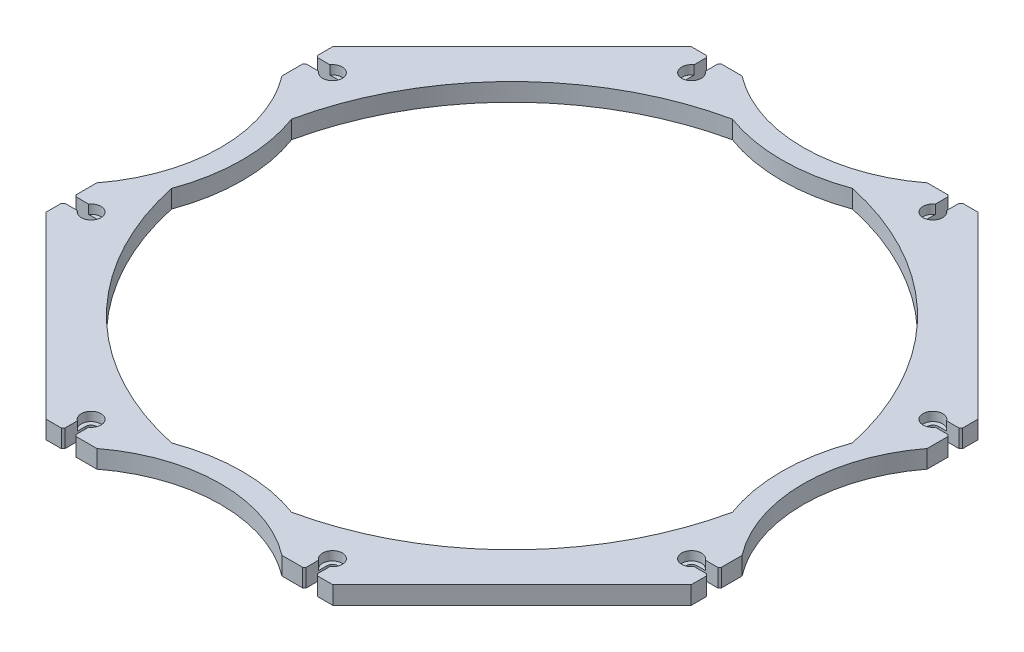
from build123d import *

# Parameters (mm, degrees)
SKETCH3_W            = 457.2
SKETCH3_H            = 457.2
PLATE_DEPTH          = 12.7
SKETCH4_R            = 107.95
SAMPLER_MOUNT_DEPTH  = 647.703154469
SKETCH6_R            = 6.985
MOUNT_C_BORES_DEPTH  = 6.35
SAMPLER_MOUNTS_COUNT = 4
CUT_EXTRUDE3_DEPTH   = 647.703154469
CHAMFER1_SIZE        = 127


with BuildPart() as part:
    # Sketch3 → plate (new body)
    with BuildSketch(Plane(origin=(0, 0, 0), x_dir=(1, 0, 0), z_dir=(0, 1, 0))):
        with Locations((228.6, 228.6)):
            Rectangle(SKETCH3_W, SKETCH3_H)
    extrude(amount=PLATE_DEPTH)

    # Sketch4 → sampler mount (cut, through all)
    with BuildSketch(Plane(origin=(0, 12.7, 0), x_dir=(-1, 0, 0), z_dir=(0, 1, 0))):
        with Locations((-542.925, -228.6)):
            Circle(SKETCH4_R)
        with BuildLine():
            Line((-457.2, -148.34235), (-457.2, -137.86485))
            Line((-457.2, -137.86485), (-455.93, -139.13485))
            Line((-455.93, -139.13485), (-441.325, -139.13485))
            ThreePointArc((-441.325, -139.13485), (-437.35625, -143.1036), (-441.325, -147.07235))
            Line((-441.325, -147.07235), (-455.93, -147.07235))
            Line((-455.93, -147.07235), (-457.2, -148.34235))
        make_face()
        with BuildLine():
            Line((-441.325, -318.06515), (-455.93, -318.06515))
            Line((-455.93, -318.06515), (-457.2, -319.33515))
            Line((-457.2, -319.33515), (-457.2, -308.85765))
            Line((-457.2, -308.85765), (-455.93, -310.12765))
            Line((-455.93, -310.12765), (-441.325, -310.12765))
            ThreePointArc((-441.325, -310.12765), (-437.35625, -314.0964), (-441.325, -318.06515))
        make_face()
    sampler_mount = extrude(amount=-SAMPLER_MOUNT_DEPTH, mode=Mode.SUBTRACT)

    # Sketch6 → mount c bores (cut)
    with BuildSketch(Plane(origin=(0, 12.7, 0), x_dir=(-1, 0, 0), z_dir=(0, 1, 0))):
        with Locations((-441.325, -314.0964)):
            Circle(SKETCH6_R)
        with Locations((-441.325, -143.1036)):
            Circle(SKETCH6_R)
    mount_c_bores = extrude(amount=-MOUNT_C_BORES_DEPTH, mode=Mode.SUBTRACT)

    # sampler mounts: sampler mount, mount c bores ×4 about axis
    sampler_mounts_axis = Axis((228.6, 0, -228.6), (0, 1, 0))
    add([sampler_mount.rotate(sampler_mounts_axis, i * 360 / SAMPLER_MOUNTS_COUNT) for i in range(1, SAMPLER_MOUNTS_COUNT)], mode=Mode.SUBTRACT)
    add([mount_c_bores.rotate(sampler_mounts_axis, i * 360 / SAMPLER_MOUNTS_COUNT) for i in range(1, SAMPLER_MOUNTS_COUNT)], mode=Mode.SUBTRACT)

    # Sketch8 → Cut-Extrude3 (cut, through all)
    with BuildSketch(Plane(origin=(0, 12.7, 0), x_dir=(-1, 0, 0), z_dir=(0, 1, 0))):
        with BuildLine():
            ThreePointArc((-29.896954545, -186.087181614), (-84.915902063, -84.915902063), (-186.087181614, -29.896954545))
            ThreePointArc((-186.087181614, -29.896954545), (-228.6, -37.465), (-271.112818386, -29.896954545))
            ThreePointArc((-271.112818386, -29.896954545), (-372.284097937, -84.915902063), (-427.303045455, -186.087181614))
            ThreePointArc((-427.303045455, -186.087181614), (-419.735, -228.6), (-427.303045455, -271.112818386))
            ThreePointArc((-427.303045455, -271.112818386), (-372.284097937, -372.284097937), (-271.112818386, -427.303045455))
            ThreePointArc((-271.112818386, -427.303045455), (-228.6, -419.735), (-186.087181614, -427.303045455))
            ThreePointArc((-186.087181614, -427.303045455), (-84.915902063, -372.284097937), (-29.896954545, -271.112818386))
            ThreePointArc((-29.896954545, -271.112818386), (-37.465, -228.6), (-29.896954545, -186.087181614))
        make_face()
    extrude(amount=-CUT_EXTRUDE3_DEPTH, mode=Mode.SUBTRACT)

    # Chamfer1
    chamfer1_edges = [part.edges().sort_by_distance(p)[0] for p in [
        (0, 6.35, -457.2),
        (457.2, 6.35, -457.2),
        (457.2, 6.35, 0),
        (0, 6.35, 0),
    ]]
    chamfer(chamfer1_edges, length=CHAMFER1_SIZE)


solid = part.part
